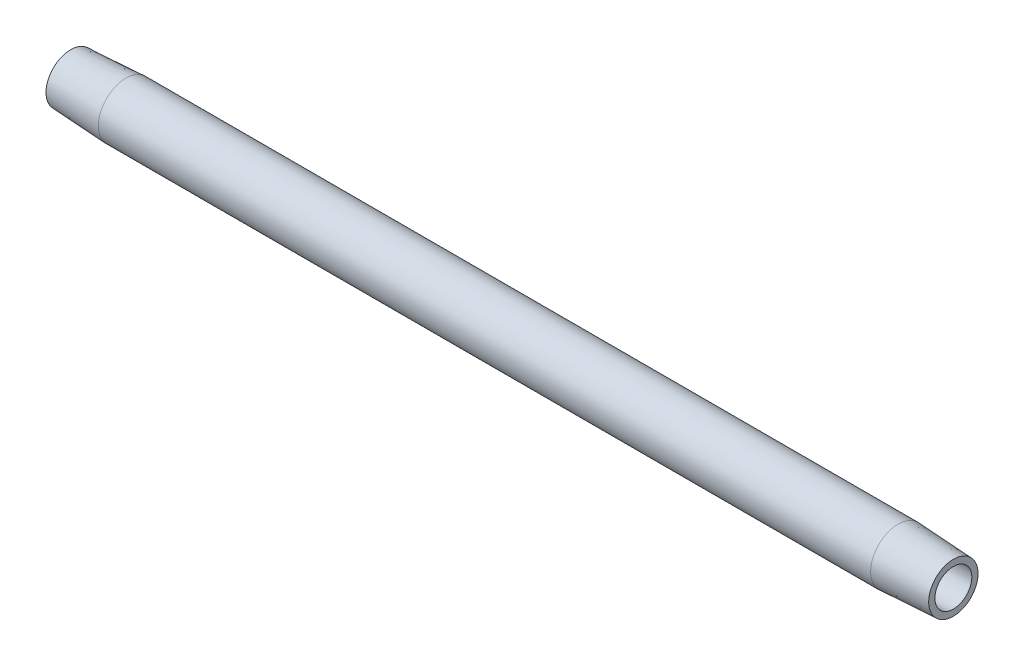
from build123d import *


with BuildPart() as part:
    # Sketch2 → Revolve1 (revolve)
    with BuildSketch(Plane.XY, mode=Mode.PRIVATE) as revolve1_sk:
        Polygon((7.9375, 3.96875), (0, 3.552763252), (0, 2.6543), (127, 2.6543), (127, 3.552763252), (119.0625, 3.96875), align=None)
    revolve(revolve1_sk.sketch.rotate(Axis((0.476141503, 0, 0), (1, 0, 0)), 90), axis=Axis((0.476141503, 0, 0), (1, 0, 0)))


solid = part.part
